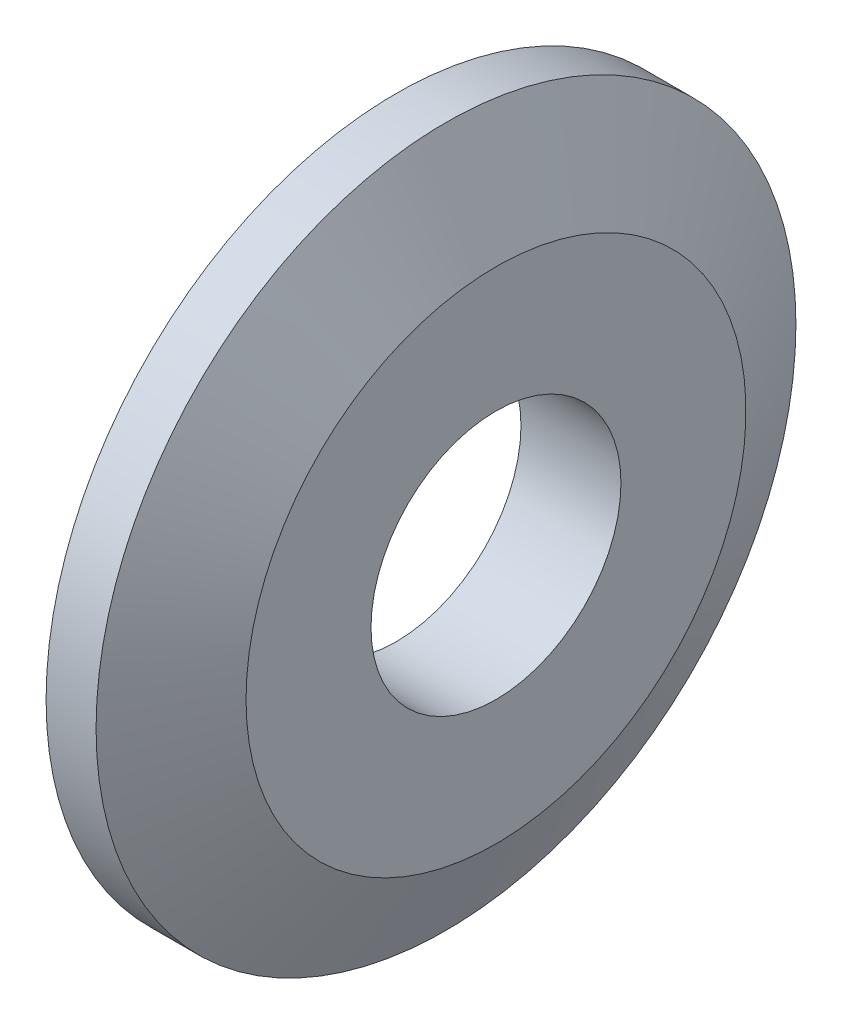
from build123d import *


with BuildPart() as part:
    # Esquisse1 → R_volution1 (revolve)
    with BuildSketch(Plane.XY, mode=Mode.PRIVATE) as r_volution1_sk:
        Polygon((0, 2.5), (0, 7), (1, 7), (2, 5), (2, 2.5), align=None)
    revolve(r_volution1_sk.sketch.rotate(Axis((0, 0, 0), (1, 0, 0)), 90), axis=Axis((0, 0, 0), (1, 0, 0)))


solid = part.part
